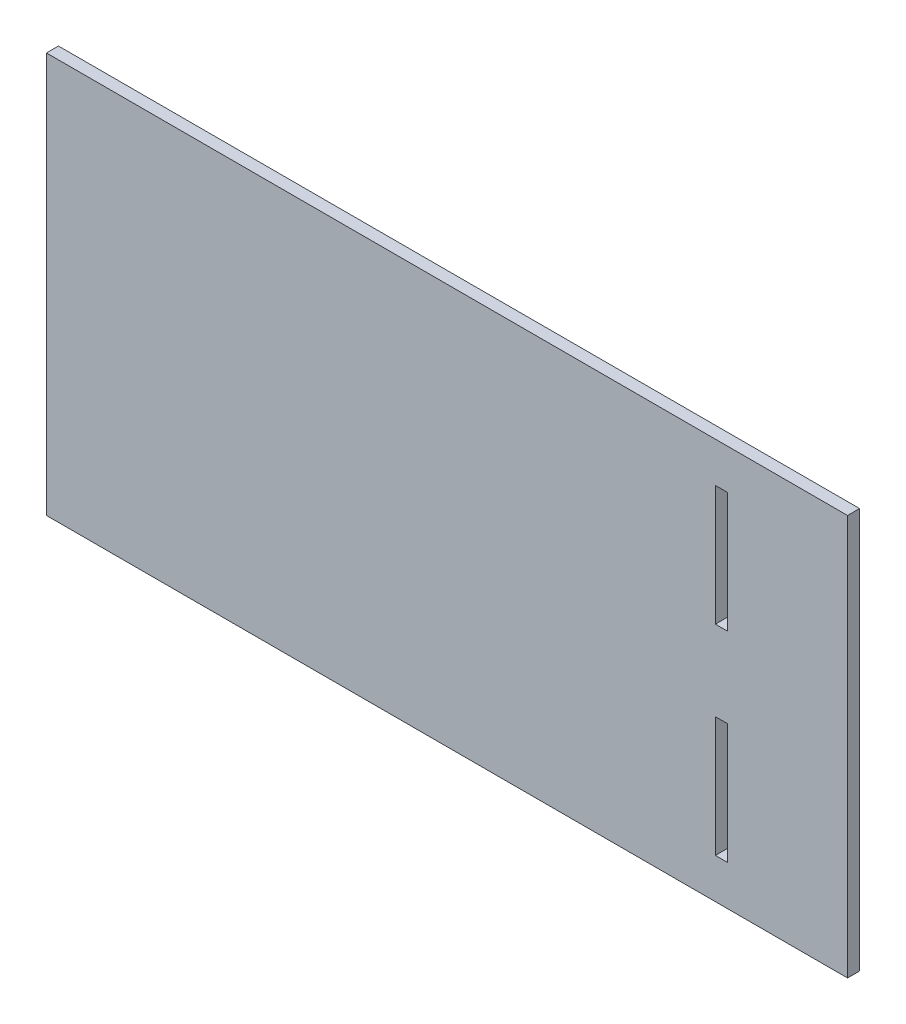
from build123d import *

# Parameters (mm, degrees)
ESQUISSE1_W             = 200
ESQUISSE1_H             = 100
BOSS_EXTRU_1_DEPTH      = 3
ESQUISSE2_W             = 3
ESQUISSE2_H             = 30
ENL_V_MAT_EXTRU_1_DEPTH = 112.843640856


with BuildPart() as part:
    # Esquisse1 → Boss.-Extru.1 (new body)
    with BuildSketch(Plane.XY):
        Rectangle(ESQUISSE1_W, ESQUISSE1_H)
    extrude(amount=BOSS_EXTRU_1_DEPTH)

    # Esquisse2 → Enl_v. mat.-Extru.1 (cut, through all)
    with BuildSketch(Plane.XY.offset(3)):
        with Locations((68.5, -25)):
            Rectangle(ESQUISSE2_W, ESQUISSE2_H)
        with Locations((68.5, 25)):
            Rectangle(ESQUISSE2_W, ESQUISSE2_H)
    extrude(amount=-ENL_V_MAT_EXTRU_1_DEPTH, mode=Mode.SUBTRACT)


solid = part.part
